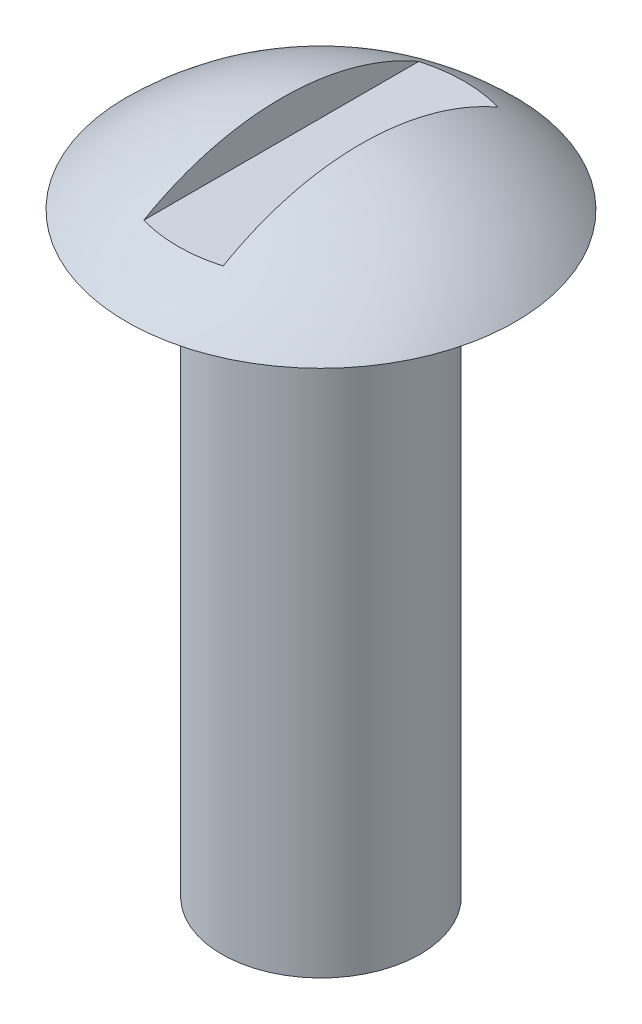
from build123d import *

# Parameters (mm, degrees)
ENL_V_MAT_EXTRU_1_DEPTH      = 20.17667587
ENL_V_MAT_EXTRU_1_DEPTH_BACK = 20.17667587
ESQUISSE2_W                  = 2
ESQUISSE2_H                  = 8.006526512


with BuildPart() as part:
    # Esquisse1 → R_volution1 (revolve)
    with BuildSketch(Plane.XY, mode=Mode.PRIVATE) as r_volution1_sk:
        with BuildLine():
            Line((0, 0), (0, 15))
            Line((0, 15), (2.398979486, 15))
            ThreePointArc((2.398979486, 15), (0.145751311, 16.480740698), (-2.5, 17))
            Line((-2.5, 17), (-2.5, 0))
            Line((-2.5, 0), (0, 0))
        make_face()
    revolve(r_volution1_sk.sketch.rotate(Axis((-2.5, 24.711714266, 0), (0, -1, 0)), 180), axis=Axis((-2.5, 24.711714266, 0), (0, -1, 0)))

    # Esquisse2 → Enl_v. mat.-Extru.1 (cut, two sides: drawn at the far end of the back side and taken through both)
    with BuildSketch(Plane.XY.offset(-ENL_V_MAT_EXTRU_1_DEPTH_BACK)):
        with Locations((-2.5, 20.003263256)):
            Rectangle(ESQUISSE2_W, ESQUISSE2_H)
    extrude(amount=ENL_V_MAT_EXTRU_1_DEPTH + ENL_V_MAT_EXTRU_1_DEPTH_BACK, mode=Mode.SUBTRACT)


solid = part.part
